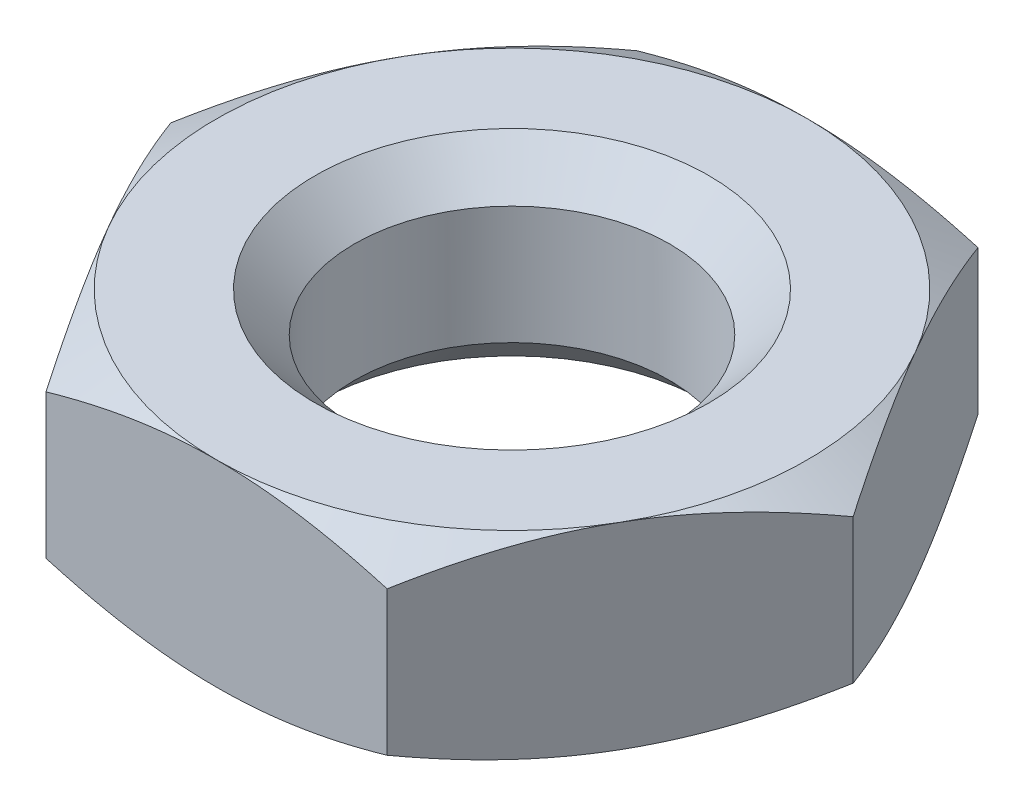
ISO-10303-21;
HEADER;
FILE_DESCRIPTION(('STEP AP214'),'2;1');
FILE_NAME('part.step','',(''),(''),'','','');
FILE_SCHEMA(('AUTOMOTIVE_DESIGN { 1 0 10303 214 1 1 1 1 }'));
ENDSEC;
DATA;
#1=APPLICATION_CONTEXT('core data for automotive mechanical design processes');
#2=APPLICATION_PROTOCOL_DEFINITION('international standard','automotive_design',2000,#1);
#3=PRODUCT_CONTEXT('',#1,'mechanical');
#4=PRODUCT('Part','Part','',(#3));
#5=PRODUCT_RELATED_PRODUCT_CATEGORY('part','',(#4));
#6=PRODUCT_DEFINITION_FORMATION('','',#4);
#7=PRODUCT_DEFINITION_CONTEXT('part definition',#1,'design');
#8=PRODUCT_DEFINITION('design','',#6,#7);
#9=PRODUCT_DEFINITION_SHAPE('','',#8);
#10=(LENGTH_UNIT() NAMED_UNIT(*) SI_UNIT(.MILLI.,.METRE.));
#11=(NAMED_UNIT(*) PLANE_ANGLE_UNIT() SI_UNIT($,.RADIAN.));
#12=(NAMED_UNIT(*) SI_UNIT($,.STERADIAN.) SOLID_ANGLE_UNIT());
#13=UNCERTAINTY_MEASURE_WITH_UNIT(LENGTH_MEASURE(1.E-05),#10,'distance_accuracy_value','');
#14=(GEOMETRIC_REPRESENTATION_CONTEXT(3) GLOBAL_UNCERTAINTY_ASSIGNED_CONTEXT((#13)) GLOBAL_UNIT_ASSIGNED_CONTEXT((#10,
#11,#12)) REPRESENTATION_CONTEXT('',''));
#15=CARTESIAN_POINT('',(0.,0.,0.));
#16=DIRECTION('',(0.,0.,1.));
#17=DIRECTION('',(1.,0.,0.));
#18=AXIS2_PLACEMENT_3D('',#15,#16,#17);
#19=CARTESIAN_POINT('',(0.,6.41280525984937,0.));
#20=DIRECTION('',(0.,-1.,0.));
#21=DIRECTION('',(1.,0.,0.));
#22=AXIS2_PLACEMENT_3D('',#19,#20,#21);
#23=CONICAL_SURFACE('',#22,21.2132034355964,1.04719754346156);
#24=CARTESIAN_POINT('',(-17.3206235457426,8.6601873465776,0.000199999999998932));
#25=CARTESIAN_POINT('',(-17.1302745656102,8.77007818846,-0.329494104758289));
#26=CARTESIAN_POINT('',(-16.9391831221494,8.87498239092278,-0.660474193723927));
#27=CARTESIAN_POINT('',(-16.5554679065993,9.07343140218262,-1.32508844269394));
#28=CARTESIAN_POINT('',(-16.3628436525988,9.16697247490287,-1.65872343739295));
#29=CARTESIAN_POINT('',(-15.975690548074,9.34143784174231,-2.32929228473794));
#30=CARTESIAN_POINT('',(-15.781158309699,9.42233228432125,-2.66623200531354));
#31=CARTESIAN_POINT('',(-15.3907420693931,9.56976735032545,-3.34245276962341));
#32=CARTESIAN_POINT('',(-15.194858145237,9.63630879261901,-3.6817336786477));
#33=CARTESIAN_POINT('',(-14.8067578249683,9.75220762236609,-4.35394315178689));
#34=CARTESIAN_POINT('',(-14.6145702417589,9.80194861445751,-4.68682181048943));
#35=CARTESIAN_POINT('',(-14.229314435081,9.88535325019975,-5.35410444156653));
#36=CARTESIAN_POINT('',(-14.0362461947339,9.91901658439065,-5.68850844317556));
#37=CARTESIAN_POINT('',(-13.6497853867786,9.96941592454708,-6.35787819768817));
#38=CARTESIAN_POINT('',(-13.4563934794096,9.98617204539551,-6.692842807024));
#39=CARTESIAN_POINT('',(-13.0694311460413,10.0023966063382,-7.36308122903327));
#40=CARTESIAN_POINT('',(-12.875860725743,10.001865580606,-7.69835503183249));
#41=CARTESIAN_POINT('',(-12.513982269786,9.98472338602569,-8.3251469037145));
#42=CARTESIAN_POINT('',(-12.3456484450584,9.97020315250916,-8.61670964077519));
#43=CARTESIAN_POINT('',(-12.0093680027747,9.92836285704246,-9.19916445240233));
#44=CARTESIAN_POINT('',(-11.8414214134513,9.90104188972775,-9.49005647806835));
#45=CARTESIAN_POINT('',(-11.5060066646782,9.83407648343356,-10.0710118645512));
#46=CARTESIAN_POINT('',(-11.3385390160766,9.79442186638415,-10.3610743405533));
#47=CARTESIAN_POINT('',(-11.0043888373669,9.70348488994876,-10.9398394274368));
#48=CARTESIAN_POINT('',(-10.8377063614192,9.65220174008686,-11.2285419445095));
#49=CARTESIAN_POINT('',(-10.3317324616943,9.47961312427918,-12.1049144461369));
#50=CARTESIAN_POINT('',(-9.99390625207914,9.34109880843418,-12.6900466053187));
#51=CARTESIAN_POINT('',(-9.32329121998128,9.02672801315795,-13.8515859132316));
#52=CARTESIAN_POINT('',(-8.99049381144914,8.85094536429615,-14.4280079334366));
#53=CARTESIAN_POINT('',(-8.66013856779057,8.66018734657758,-15.0002));
#54=B_SPLINE_CURVE_WITH_KNOTS('',3,(#24,#25,#26,#27,#28,#29,#30,#31,#32,#33,#34,#35,#36,#37,#38,
#39,#40,#41,#42,#43,#44,#45,#46,#47,#48,#49,#50,#51,#52,#53),.UNSPECIFIED.,.F.,.F.,(4,2,2,2,2,2,
2,2,2,2,2,2,2,2,4),(0.,1.18875411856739,2.37789803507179,3.56980779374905,4.76164953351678,
5.92407381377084,7.08652046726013,8.24758249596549,9.40860864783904,10.4193068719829,
11.4300765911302,12.4416826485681,13.4533574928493,15.5211962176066,17.5849760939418),.UNSPECIFIED.);
#55=CARTESIAN_POINT('',(-17.3205080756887,8.66025401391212,0.));
#56=VERTEX_POINT('',#55);
#57=CARTESIAN_POINT('',(-12.9903810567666,10.,-7.49999999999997));
#58=VERTEX_POINT('',#57);
#59=EDGE_CURVE('E340',#56,#58,#54,.T.);
#60=ORIENTED_EDGE('',*,*,#59,.F.);
#61=CARTESIAN_POINT('',(-8.66013856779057,8.66018734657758,15.0002));
#62=CARTESIAN_POINT('',(-8.850487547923,8.77007818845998,14.6705058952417));
#63=CARTESIAN_POINT('',(-9.04157899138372,8.87498239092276,14.3395258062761));
#64=CARTESIAN_POINT('',(-9.42529420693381,9.0734314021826,13.6749115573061));
#65=CARTESIAN_POINT('',(-9.61791846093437,9.16697247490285,13.3412765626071));
#66=CARTESIAN_POINT('',(-10.0050715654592,9.3414378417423,12.6707077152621));
#67=CARTESIAN_POINT('',(-10.1996038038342,9.42233228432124,12.3337679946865));
#68=CARTESIAN_POINT('',(-10.5900200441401,9.56976735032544,11.6575472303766));
#69=CARTESIAN_POINT('',(-10.7859039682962,9.636308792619,11.3182663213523));
#70=CARTESIAN_POINT('',(-11.1740042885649,9.75220762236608,10.6460568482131));
#71=CARTESIAN_POINT('',(-11.3661918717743,9.8019486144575,10.3131781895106));
#72=CARTESIAN_POINT('',(-11.7514476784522,9.88535325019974,9.64589555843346));
#73=CARTESIAN_POINT('',(-11.9445159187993,9.91901658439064,9.31149155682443));
#74=CARTESIAN_POINT('',(-12.3309767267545,9.96941592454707,8.64212180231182));
#75=CARTESIAN_POINT('',(-12.5243686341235,9.98617204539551,8.30715719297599));
#76=CARTESIAN_POINT('',(-12.9113309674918,10.0023966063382,7.63691877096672));
#77=CARTESIAN_POINT('',(-13.1049013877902,10.001865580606,7.3016449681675));
#78=CARTESIAN_POINT('',(-13.4667798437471,9.98472338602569,6.67485309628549));
#79=CARTESIAN_POINT('',(-13.6351136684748,9.97020315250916,6.3832903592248));
#80=CARTESIAN_POINT('',(-13.9713941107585,9.92836285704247,5.80083554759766));
#81=CARTESIAN_POINT('',(-14.1393407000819,9.90104188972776,5.50994352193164));
#82=CARTESIAN_POINT('',(-14.474755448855,9.83407648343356,4.92898813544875));
#83=CARTESIAN_POINT('',(-14.6422230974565,9.79442186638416,4.63892565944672));
#84=CARTESIAN_POINT('',(-14.9763732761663,9.70348488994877,4.0601605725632));
#85=CARTESIAN_POINT('',(-15.1430557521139,9.65220174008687,3.77145805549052));
#86=CARTESIAN_POINT('',(-15.6490296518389,9.47961312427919,2.8950855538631));
#87=CARTESIAN_POINT('',(-15.986855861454,9.34109880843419,2.3099533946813));
#88=CARTESIAN_POINT('',(-16.6574708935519,9.02672801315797,1.14841408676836));
#89=CARTESIAN_POINT('',(-16.990268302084,8.85094536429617,0.571992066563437));
#90=CARTESIAN_POINT('',(-17.3206235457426,8.6601873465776,-0.000199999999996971));
#91=B_SPLINE_CURVE_WITH_KNOTS('',3,(#61,#62,#63,#64,#65,#66,#67,#68,#69,#70,#71,#72,#73,#74,#75,
#76,#77,#78,#79,#80,#81,#82,#83,#84,#85,#86,#87,#88,#89,#90),.UNSPECIFIED.,.F.,.F.,(4,2,2,2,2,2,
2,2,2,2,2,2,2,2,4),(0.,1.18875411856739,2.3778980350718,3.56980779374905,4.76164953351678,
5.92407381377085,7.08652046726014,8.2475824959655,9.40860864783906,10.4193068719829,
11.4300765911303,12.4416826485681,13.4533574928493,15.5211962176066,17.5849760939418),.UNSPECIFIED.);
#92=CARTESIAN_POINT('',(-12.9903810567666,10.,7.49999999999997));
#93=VERTEX_POINT('',#92);
#94=EDGE_CURVE('E186',#93,#56,#91,.T.);
#95=ORIENTED_EDGE('',*,*,#94,.F.);
#96=CARTESIAN_POINT('',(0.,10.,0.));
#97=DIRECTION('',(0.,1.,0.));
#98=DIRECTION('',(-1.,0.,0.));
#99=AXIS2_PLACEMENT_3D('',#96,#97,#98);
#100=CIRCLE('',#99,15.);
#101=EDGE_CURVE('E268',#58,#93,#100,.T.);
#102=ORIENTED_EDGE('',*,*,#101,.F.);
#103=EDGE_LOOP('',(#60,#95,#102));
#104=FACE_BOUND('',#103,.T.);
#105=ADVANCED_FACE('F34',(#104),#23,.T.);
#106=CARTESIAN_POINT('',(-8.66025403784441,8.6602540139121,-15.));
#107=VERTEX_POINT('',#106);
#108=EDGE_CURVE('E192',#58,#107,#54,.T.);
#109=ORIENTED_EDGE('',*,*,#108,.F.);
#110=CARTESIAN_POINT('',(0.,10.,-15.));
#111=VERTEX_POINT('',#110);
#112=EDGE_CURVE('E270',#111,#58,#100,.T.);
#113=ORIENTED_EDGE('',*,*,#112,.F.);
#114=CARTESIAN_POINT('',(-23.2814633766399,2.67039736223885,-15.));
#115=CARTESIAN_POINT('',(-22.9538281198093,2.82940811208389,-15.));
#116=CARTESIAN_POINT('',(-22.6258089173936,2.98762738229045,-15.));
#117=CARTESIAN_POINT('',(-21.9689225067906,3.30230374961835,-15.));
#118=CARTESIAN_POINT('',(-21.6400552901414,3.45876082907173,-15.));
#119=CARTESIAN_POINT('',(-20.6519741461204,3.92526106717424,-15.));
#120=CARTESIAN_POINT('',(-19.9913773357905,4.23238620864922,-15.));
#121=CARTESIAN_POINT('',(-18.6621834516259,4.83865113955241,-15.));
#122=CARTESIAN_POINT('',(-17.9935624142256,5.13773851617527,-15.));
#123=CARTESIAN_POINT('',(-16.6510098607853,5.7237042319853,-15.));
#124=CARTESIAN_POINT('',(-15.9770785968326,6.01058314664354,-15.));
#125=CARTESIAN_POINT('',(-14.6009780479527,6.57791246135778,-15.));
#126=CARTESIAN_POINT('',(-13.8985991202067,6.85785700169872,-15.));
#127=CARTESIAN_POINT('',(-12.4856258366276,7.39660574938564,-15.));
#128=CARTESIAN_POINT('',(-11.7750305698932,7.65540758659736,-15.));
#129=CARTESIAN_POINT('',(-10.3458412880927,8.14508670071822,-15.));
#130=CARTESIAN_POINT('',(-9.62726674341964,8.37602034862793,-15.));
#131=CARTESIAN_POINT('',(-8.17974171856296,8.80257821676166,-15.));
#132=CARTESIAN_POINT('',(-7.45079457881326,8.99821353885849,-15.));
#133=CARTESIAN_POINT('',(-6.35149009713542,9.25758588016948,-15.));
#134=CARTESIAN_POINT('',(-5.98508799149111,9.33818830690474,-15.));
#135=CARTESIAN_POINT('',(-5.24977663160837,9.48707546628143,-15.));
#136=CARTESIAN_POINT('',(-4.88086742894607,9.55536045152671,-15.));
#137=CARTESIAN_POINT('',(-4.14079375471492,9.6784087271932,-15.));
#138=CARTESIAN_POINT('',(-3.76962930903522,9.73317217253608,-15.));
#139=CARTESIAN_POINT('',(-3.02543966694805,9.82808513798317,-15.));
#140=CARTESIAN_POINT('',(-2.65241455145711,9.86823528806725,-15.));
#141=CARTESIAN_POINT('',(-1.90990058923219,9.93262005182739,-15.));
#142=CARTESIAN_POINT('',(-1.54042930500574,9.95705596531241,-15.));
#143=CARTESIAN_POINT('',(-0.800785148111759,9.99028040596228,-15.));
#144=CARTESIAN_POINT('',(-0.430612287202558,9.99906919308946,-15.));
#145=CARTESIAN_POINT('',(0.309774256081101,10.0007903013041,-15.));
#146=CARTESIAN_POINT('',(0.679987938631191,9.99372255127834,-15.));
#147=CARTESIAN_POINT('',(1.41978709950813,9.96390312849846,-15.));
#148=CARTESIAN_POINT('',(1.78937254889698,9.94115075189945,-15.));
#149=CARTESIAN_POINT('',(2.67703968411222,9.86815109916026,-15.));
#150=CARTESIAN_POINT('',(3.19452269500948,9.81049326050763,-15.));
#151=CARTESIAN_POINT('',(4.22566359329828,9.66756388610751,-15.));
#152=CARTESIAN_POINT('',(4.73932095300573,9.58228861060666,-15.));
#153=CARTESIAN_POINT('',(5.7623161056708,9.38715789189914,-15.));
#154=CARTESIAN_POINT('',(6.27165021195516,9.27728330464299,-15.));
#155=CARTESIAN_POINT('',(7.28521654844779,9.03630813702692,-15.));
#156=CARTESIAN_POINT('',(7.78944885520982,8.90520787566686,-15.));
#157=CARTESIAN_POINT('',(8.80388330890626,8.62187888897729,-15.));
#158=CARTESIAN_POINT('',(9.31397251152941,8.46924857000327,-15.));
#159=CARTESIAN_POINT('',(10.3291263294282,8.14818936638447,-15.));
#160=CARTESIAN_POINT('',(10.8341909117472,7.97976037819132,-15.));
#161=CARTESIAN_POINT('',(11.8395443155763,7.62978058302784,-15.));
#162=CARTESIAN_POINT('',(12.3398346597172,7.44823412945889,-15.));
#163=CARTESIAN_POINT('',(13.3362682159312,7.07415799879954,-15.));
#164=CARTESIAN_POINT('',(13.8324114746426,6.88162844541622,-15.));
#165=CARTESIAN_POINT('',(14.9951014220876,6.41798936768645,-15.));
#166=CARTESIAN_POINT('',(15.6601315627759,6.14308265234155,-15.));
#167=CARTESIAN_POINT('',(16.9845867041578,5.58004500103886,-15.));
#168=CARTESIAN_POINT('',(17.6440113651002,5.29191327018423,-15.));
#169=CARTESIAN_POINT('',(18.9582875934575,4.7050499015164,-15.));
#170=CARTESIAN_POINT('',(19.6131381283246,4.40631595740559,-15.));
#171=CARTESIAN_POINT('',(20.9188775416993,3.80036761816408,-15.));
#172=CARTESIAN_POINT('',(21.5697665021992,3.49315339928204,-15.));
#173=CARTESIAN_POINT('',(22.8689334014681,2.87148235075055,-15.));
#174=CARTESIAN_POINT('',(23.5172077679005,2.55701806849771,-15.));
#175=CARTESIAN_POINT('',(24.8109635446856,1.92239686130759,-15.));
#176=CARTESIAN_POINT('',(25.4564449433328,1.60223991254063,-15.));
#177=CARTESIAN_POINT('',(26.7449591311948,0.957242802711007,-15.));
#178=CARTESIAN_POINT('',(27.3879922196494,0.632403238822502,-15.));
#179=CARTESIAN_POINT('',(28.67204255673,-0.0212380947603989,-15.));
#180=CARTESIAN_POINT('',(29.3130597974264,-0.350039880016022,-15.));
#181=CARTESIAN_POINT('',(31.1273189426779,-1.28661427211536,-15.));
#182=CARTESIAN_POINT('',(32.2985274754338,-1.89832573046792,-15.));
#183=CARTESIAN_POINT('',(34.6365647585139,-3.13013975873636,-15.));
#184=CARTESIAN_POINT('',(35.8033933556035,-3.7502426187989,-15.));
#185=CARTESIAN_POINT('',(38.1307381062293,-4.99534651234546,-15.));
#186=CARTESIAN_POINT('',(39.2912627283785,-5.62033172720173,-15.));
#187=CARTESIAN_POINT('',(41.0299793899,-6.5615543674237,-15.));
#188=CARTESIAN_POINT('',(41.6091911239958,-6.87591093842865,-15.));
#189=CARTESIAN_POINT('',(42.7670021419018,-7.5057478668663,-15.));
#190=CARTESIAN_POINT('',(43.3456014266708,-7.82122822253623,-15.));
#191=CARTESIAN_POINT('',(43.9239290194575,-8.13720599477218,-15.));
#192=B_SPLINE_CURVE_WITH_KNOTS('',3,(#114,#115,#116,#117,#118,#119,#120,#121,#122,#123,#124,
#125,#126,#127,#128,#129,#130,#131,#132,#133,#134,#135,#136,#137,#138,#139,#140,#141,#142,#143,
#144,#145,#146,#147,#148,#149,#150,#151,#152,#153,#154,#155,#156,#157,#158,#159,#160,#161,#162,
#163,#164,#165,#166,#167,#168,#169,#170,#171,#172,#173,#174,#175,#176,#177,#178,#179,#180,#181,
#182,#183,#184,#185,#186,#187,#188,#189,#190,#191),.UNSPECIFIED.,.F.,.F.,(4,2,2,2,2,2,2,2,2,2,2,
2,2,2,2,2,2,2,2,2,2,2,2,2,2,2,2,2,2,2,2,2,2,2,2,2,2,2,4),(0.,1.09254711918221,2.18510518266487,
4.37054362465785,6.56784837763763,8.7650494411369,11.033125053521,13.3014545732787,
15.565116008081,17.8280642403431,18.9533795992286,20.0786718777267,21.2039512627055,
22.3291821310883,23.4396954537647,24.5501903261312,25.6606901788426,26.7712398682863,
28.3324320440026,29.8938357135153,31.4564587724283,33.0190583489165,34.6160574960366,
36.2130671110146,37.8095491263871,39.406013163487,41.56465041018,43.7234175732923,
45.8826572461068,48.0418520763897,50.2033752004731,52.3649073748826,54.5261662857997,
56.6874336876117,60.6513806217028,64.6154649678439,68.5697894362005,70.5468460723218,
72.5238996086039),.UNSPECIFIED.);
#193=EDGE_CURVE('E205',#107,#111,#192,.T.);
#194=ORIENTED_EDGE('',*,*,#193,.F.);
#195=EDGE_LOOP('',(#109,#113,#194));
#196=FACE_BOUND('',#195,.T.);
#197=ADVANCED_FACE('F169',(#196),#23,.T.);
#198=CARTESIAN_POINT('',(8.66025403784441,8.6602540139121,-15.));
#199=VERTEX_POINT('',#198);
#200=EDGE_CURVE('E199',#111,#199,#192,.T.);
#201=ORIENTED_EDGE('',*,*,#200,.F.);
#202=CARTESIAN_POINT('',(12.9903810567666,10.,-7.49999999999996));
#203=VERTEX_POINT('',#202);
#204=EDGE_CURVE('E360',#203,#111,#100,.T.);
#205=ORIENTED_EDGE('',*,*,#204,.F.);
#206=CARTESIAN_POINT('',(8.66013856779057,8.66018734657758,-15.0002));
#207=CARTESIAN_POINT('',(8.850487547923,8.77007818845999,-14.6705058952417));
#208=CARTESIAN_POINT('',(9.04157899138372,8.87498239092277,-14.3395258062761));
#209=CARTESIAN_POINT('',(9.42529420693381,9.07343140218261,-13.6749115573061));
#210=CARTESIAN_POINT('',(9.61791846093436,9.16697247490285,-13.3412765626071));
#211=CARTESIAN_POINT('',(10.0050715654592,9.3414378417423,-12.6707077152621));
#212=CARTESIAN_POINT('',(10.1996038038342,9.42233228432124,-12.3337679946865));
#213=CARTESIAN_POINT('',(10.5900200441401,9.56976735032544,-11.6575472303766));
#214=CARTESIAN_POINT('',(10.7859039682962,9.636308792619,-11.3182663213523));
#215=CARTESIAN_POINT('',(11.1740042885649,9.75220762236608,-10.6460568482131));
#216=CARTESIAN_POINT('',(11.3661918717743,9.8019486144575,-10.3131781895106));
#217=CARTESIAN_POINT('',(11.7514476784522,9.88535325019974,-9.64589555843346));
#218=CARTESIAN_POINT('',(11.9445159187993,9.91901658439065,-9.31149155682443));
#219=CARTESIAN_POINT('',(12.3309767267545,9.96941592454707,-8.64212180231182));
#220=CARTESIAN_POINT('',(12.5243686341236,9.98617204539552,-8.30715719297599));
#221=CARTESIAN_POINT('',(12.9113309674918,10.0023966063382,-7.63691877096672));
#222=CARTESIAN_POINT('',(13.1049013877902,10.001865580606,-7.30164496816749));
#223=CARTESIAN_POINT('',(13.4667798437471,9.9847233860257,-6.67485309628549));
#224=CARTESIAN_POINT('',(13.6351136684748,9.97020315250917,-6.3832903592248));
#225=CARTESIAN_POINT('',(13.9713941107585,9.92836285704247,-5.80083554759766));
#226=CARTESIAN_POINT('',(14.1393407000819,9.90104188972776,-5.50994352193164));
#227=CARTESIAN_POINT('',(14.474755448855,9.83407648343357,-4.92898813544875));
#228=CARTESIAN_POINT('',(14.6422230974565,9.79442186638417,-4.63892565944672));
#229=CARTESIAN_POINT('',(14.9763732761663,9.70348488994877,-4.0601605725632));
#230=CARTESIAN_POINT('',(15.1430557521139,9.65220174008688,-3.77145805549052));
#231=CARTESIAN_POINT('',(15.6490296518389,9.47961312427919,-2.8950855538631));
#232=CARTESIAN_POINT('',(15.986855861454,9.3410988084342,-2.3099533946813));
#233=CARTESIAN_POINT('',(16.6574708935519,9.02672801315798,-1.14841408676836));
#234=CARTESIAN_POINT('',(16.990268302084,8.85094536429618,-0.571992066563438));
#235=CARTESIAN_POINT('',(17.3206235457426,8.6601873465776,0.000199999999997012));
#236=B_SPLINE_CURVE_WITH_KNOTS('',3,(#206,#207,#208,#209,#210,#211,#212,#213,#214,#215,#216,
#217,#218,#219,#220,#221,#222,#223,#224,#225,#226,#227,#228,#229,#230,#231,#232,#233,#234,#235),
.UNSPECIFIED.,.F.,.F.,(4,2,2,2,2,2,2,2,2,2,2,2,2,2,4),(0.,1.1887541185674,2.3778980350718,
3.56980779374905,4.76164953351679,5.92407381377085,7.08652046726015,8.24758249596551,
9.40860864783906,10.4193068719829,11.4300765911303,12.4416826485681,13.4533574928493,
15.5211962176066,17.5849760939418),.UNSPECIFIED.);
#237=EDGE_CURVE('E261',#199,#203,#236,.T.);
#238=ORIENTED_EDGE('',*,*,#237,.F.);
#239=EDGE_LOOP('',(#201,#205,#238));
#240=FACE_BOUND('',#239,.T.);
#241=ADVANCED_FACE('F361',(#240),#23,.T.);
#242=CARTESIAN_POINT('',(-8.66025403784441,8.6602540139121,15.));
#243=VERTEX_POINT('',#242);
#244=EDGE_CURVE('E234',#243,#93,#91,.T.);
#245=ORIENTED_EDGE('',*,*,#244,.F.);
#246=CARTESIAN_POINT('',(-23.2814633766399,2.67039736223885,15.));
#247=CARTESIAN_POINT('',(-22.9538281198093,2.82940811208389,15.));
#248=CARTESIAN_POINT('',(-22.6258089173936,2.98762738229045,15.));
#249=CARTESIAN_POINT('',(-21.9689225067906,3.30230374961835,15.));
#250=CARTESIAN_POINT('',(-21.6400552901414,3.45876082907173,15.));
#251=CARTESIAN_POINT('',(-20.6519741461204,3.92526106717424,15.));
#252=CARTESIAN_POINT('',(-19.9913773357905,4.23238620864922,15.));
#253=CARTESIAN_POINT('',(-18.6621834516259,4.83865113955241,15.));
#254=CARTESIAN_POINT('',(-17.9935624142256,5.13773851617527,15.));
#255=CARTESIAN_POINT('',(-16.6510098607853,5.7237042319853,15.));
#256=CARTESIAN_POINT('',(-15.9770785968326,6.01058314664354,15.));
#257=CARTESIAN_POINT('',(-14.6009780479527,6.57791246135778,15.));
#258=CARTESIAN_POINT('',(-13.8985991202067,6.85785700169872,15.));
#259=CARTESIAN_POINT('',(-12.4856258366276,7.39660574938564,15.));
#260=CARTESIAN_POINT('',(-11.7750305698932,7.65540758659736,15.));
#261=CARTESIAN_POINT('',(-10.3458412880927,8.14508670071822,15.));
#262=CARTESIAN_POINT('',(-9.62726674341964,8.37602034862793,15.));
#263=CARTESIAN_POINT('',(-8.17974171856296,8.80257821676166,15.));
#264=CARTESIAN_POINT('',(-7.45079457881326,8.99821353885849,15.));
#265=CARTESIAN_POINT('',(-6.35149009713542,9.25758588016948,15.));
#266=CARTESIAN_POINT('',(-5.98508799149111,9.33818830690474,15.));
#267=CARTESIAN_POINT('',(-5.24977663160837,9.48707546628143,15.));
#268=CARTESIAN_POINT('',(-4.88086742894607,9.55536045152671,15.));
#269=CARTESIAN_POINT('',(-4.14079375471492,9.6784087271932,15.));
#270=CARTESIAN_POINT('',(-3.76962930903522,9.73317217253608,15.));
#271=CARTESIAN_POINT('',(-3.02543966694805,9.82808513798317,15.));
#272=CARTESIAN_POINT('',(-2.65241455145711,9.86823528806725,15.));
#273=CARTESIAN_POINT('',(-1.90990058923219,9.93262005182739,15.));
#274=CARTESIAN_POINT('',(-1.54042930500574,9.95705596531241,15.));
#275=CARTESIAN_POINT('',(-0.800785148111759,9.99028040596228,15.));
#276=CARTESIAN_POINT('',(-0.430612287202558,9.99906919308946,15.));
#277=CARTESIAN_POINT('',(0.309774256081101,10.0007903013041,15.));
#278=CARTESIAN_POINT('',(0.679987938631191,9.99372255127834,15.));
#279=CARTESIAN_POINT('',(1.41978709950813,9.96390312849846,15.));
#280=CARTESIAN_POINT('',(1.78937254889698,9.94115075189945,15.));
#281=CARTESIAN_POINT('',(2.67703968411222,9.86815109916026,15.));
#282=CARTESIAN_POINT('',(3.19452269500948,9.81049326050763,15.));
#283=CARTESIAN_POINT('',(4.22566359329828,9.66756388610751,15.));
#284=CARTESIAN_POINT('',(4.73932095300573,9.58228861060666,15.));
#285=CARTESIAN_POINT('',(5.7623161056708,9.38715789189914,15.));
#286=CARTESIAN_POINT('',(6.27165021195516,9.27728330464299,15.));
#287=CARTESIAN_POINT('',(7.28521654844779,9.03630813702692,15.));
#288=CARTESIAN_POINT('',(7.78944885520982,8.90520787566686,15.));
#289=CARTESIAN_POINT('',(8.80388330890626,8.62187888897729,15.));
#290=CARTESIAN_POINT('',(9.31397251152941,8.46924857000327,15.));
#291=CARTESIAN_POINT('',(10.3291263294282,8.14818936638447,15.));
#292=CARTESIAN_POINT('',(10.8341909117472,7.97976037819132,15.));
#293=CARTESIAN_POINT('',(11.8395443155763,7.62978058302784,15.));
#294=CARTESIAN_POINT('',(12.3398346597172,7.44823412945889,15.));
#295=CARTESIAN_POINT('',(13.3362682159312,7.07415799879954,15.));
#296=CARTESIAN_POINT('',(13.8324114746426,6.88162844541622,15.));
#297=CARTESIAN_POINT('',(14.9951014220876,6.41798936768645,15.));
#298=CARTESIAN_POINT('',(15.6601315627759,6.14308265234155,15.));
#299=CARTESIAN_POINT('',(16.9845867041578,5.58004500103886,15.));
#300=CARTESIAN_POINT('',(17.6440113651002,5.29191327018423,15.));
#301=CARTESIAN_POINT('',(18.9582875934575,4.7050499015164,15.));
#302=CARTESIAN_POINT('',(19.6131381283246,4.40631595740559,15.));
#303=CARTESIAN_POINT('',(20.9188775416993,3.80036761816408,15.));
#304=CARTESIAN_POINT('',(21.5697665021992,3.49315339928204,15.));
#305=CARTESIAN_POINT('',(22.8689334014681,2.87148235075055,15.));
#306=CARTESIAN_POINT('',(23.5172077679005,2.55701806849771,15.));
#307=CARTESIAN_POINT('',(24.8109635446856,1.92239686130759,15.));
#308=CARTESIAN_POINT('',(25.4564449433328,1.60223991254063,15.));
#309=CARTESIAN_POINT('',(26.7449591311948,0.957242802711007,15.));
#310=CARTESIAN_POINT('',(27.3879922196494,0.632403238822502,15.));
#311=CARTESIAN_POINT('',(28.67204255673,-0.0212380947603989,15.));
#312=CARTESIAN_POINT('',(29.3130597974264,-0.350039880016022,15.));
#313=CARTESIAN_POINT('',(31.1273189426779,-1.28661427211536,15.));
#314=CARTESIAN_POINT('',(32.2985274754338,-1.89832573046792,15.));
#315=CARTESIAN_POINT('',(34.6365647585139,-3.13013975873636,15.));
#316=CARTESIAN_POINT('',(35.8033933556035,-3.7502426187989,15.));
#317=CARTESIAN_POINT('',(38.1307381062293,-4.99534651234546,15.));
#318=CARTESIAN_POINT('',(39.2912627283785,-5.62033172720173,15.));
#319=CARTESIAN_POINT('',(41.0299793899,-6.5615543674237,15.));
#320=CARTESIAN_POINT('',(41.6091911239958,-6.87591093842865,15.));
#321=CARTESIAN_POINT('',(42.7670021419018,-7.5057478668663,15.));
#322=CARTESIAN_POINT('',(43.3456014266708,-7.82122822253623,15.));
#323=CARTESIAN_POINT('',(43.9239290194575,-8.13720599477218,15.));
#324=B_SPLINE_CURVE_WITH_KNOTS('',3,(#246,#247,#248,#249,#250,#251,#252,#253,#254,#255,#256,
#257,#258,#259,#260,#261,#262,#263,#264,#265,#266,#267,#268,#269,#270,#271,#272,#273,#274,#275,
#276,#277,#278,#279,#280,#281,#282,#283,#284,#285,#286,#287,#288,#289,#290,#291,#292,#293,#294,
#295,#296,#297,#298,#299,#300,#301,#302,#303,#304,#305,#306,#307,#308,#309,#310,#311,#312,#313,
#314,#315,#316,#317,#318,#319,#320,#321,#322,#323),.UNSPECIFIED.,.F.,.F.,(4,2,2,2,2,2,2,2,2,2,2,
2,2,2,2,2,2,2,2,2,2,2,2,2,2,2,2,2,2,2,2,2,2,2,2,2,2,2,4),(0.,1.09254711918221,2.18510518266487,
4.37054362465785,6.56784837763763,8.7650494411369,11.033125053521,13.3014545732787,
15.565116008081,17.8280642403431,18.9533795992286,20.0786718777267,21.2039512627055,
22.3291821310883,23.4396954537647,24.5501903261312,25.6606901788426,26.7712398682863,
28.3324320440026,29.8938357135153,31.4564587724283,33.0190583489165,34.6160574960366,
36.2130671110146,37.8095491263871,39.406013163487,41.56465041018,43.7234175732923,
45.8826572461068,48.0418520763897,50.2033752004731,52.3649073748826,54.5261662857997,
56.6874336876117,60.6513806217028,64.6154649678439,68.5697894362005,70.5468460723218,
72.5238996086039),.UNSPECIFIED.);
#325=CARTESIAN_POINT('',(0.,10.,15.));
#326=VERTEX_POINT('',#325);
#327=EDGE_CURVE('E144',#326,#243,#324,.F.);
#328=ORIENTED_EDGE('',*,*,#327,.F.);
#329=EDGE_CURVE('E272',#93,#326,#100,.T.);
#330=ORIENTED_EDGE('',*,*,#329,.F.);
#331=EDGE_LOOP('',(#245,#328,#330));
#332=FACE_BOUND('',#331,.T.);
#333=ADVANCED_FACE('F364',(#332),#23,.T.);
#334=CARTESIAN_POINT('',(17.3205080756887,8.66025401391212,0.));
#335=VERTEX_POINT('',#334);
#336=EDGE_CURVE('E274',#203,#335,#236,.T.);
#337=ORIENTED_EDGE('',*,*,#336,.F.);
#338=CARTESIAN_POINT('',(12.9903810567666,10.,7.49999999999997));
#339=VERTEX_POINT('',#338);
#340=EDGE_CURVE('E359',#339,#203,#100,.T.);
#341=ORIENTED_EDGE('',*,*,#340,.F.);
#342=CARTESIAN_POINT('',(17.3206235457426,8.6601873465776,-0.000199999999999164));
#343=CARTESIAN_POINT('',(17.1302745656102,8.77007818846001,0.329494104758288));
#344=CARTESIAN_POINT('',(16.9391831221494,8.87498239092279,0.660474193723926));
#345=CARTESIAN_POINT('',(16.5554679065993,9.07343140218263,1.32508844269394));
#346=CARTESIAN_POINT('',(16.3628436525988,9.16697247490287,1.65872343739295));
#347=CARTESIAN_POINT('',(15.975690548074,9.34143784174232,2.32929228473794));
#348=CARTESIAN_POINT('',(15.781158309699,9.42233228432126,2.66623200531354));
#349=CARTESIAN_POINT('',(15.3907420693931,9.56976735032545,3.34245276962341));
#350=CARTESIAN_POINT('',(15.194858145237,9.63630879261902,3.6817336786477));
#351=CARTESIAN_POINT('',(14.8067578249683,9.75220762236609,4.35394315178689));
#352=CARTESIAN_POINT('',(14.6145702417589,9.80194861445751,4.68682181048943));
#353=CARTESIAN_POINT('',(14.229314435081,9.88535325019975,5.35410444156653));
#354=CARTESIAN_POINT('',(14.0362461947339,9.91901658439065,5.68850844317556));
#355=CARTESIAN_POINT('',(13.6497853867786,9.96941592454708,6.35787819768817));
#356=CARTESIAN_POINT('',(13.4563934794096,9.98617204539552,6.692842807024));
#357=CARTESIAN_POINT('',(13.0694311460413,10.0023966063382,7.36308122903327));
#358=CARTESIAN_POINT('',(12.875860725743,10.001865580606,7.69835503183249));
#359=CARTESIAN_POINT('',(12.513982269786,9.9847233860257,8.32514690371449));
#360=CARTESIAN_POINT('',(12.3456484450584,9.97020315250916,8.61670964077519));
#361=CARTESIAN_POINT('',(12.0093680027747,9.92836285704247,9.19916445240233));
#362=CARTESIAN_POINT('',(11.8414214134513,9.90104188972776,9.49005647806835));
#363=CARTESIAN_POINT('',(11.5060066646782,9.83407648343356,10.0710118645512));
#364=CARTESIAN_POINT('',(11.3385390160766,9.79442186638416,10.3610743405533));
#365=CARTESIAN_POINT('',(11.0043888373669,9.70348488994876,10.9398394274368));
#366=CARTESIAN_POINT('',(10.8377063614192,9.65220174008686,11.2285419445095));
#367=CARTESIAN_POINT('',(10.3317324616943,9.47961312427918,12.1049144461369));
#368=CARTESIAN_POINT('',(9.99390625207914,9.34109880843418,12.6900466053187));
#369=CARTESIAN_POINT('',(9.32329121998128,9.02672801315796,13.8515859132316));
#370=CARTESIAN_POINT('',(8.99049381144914,8.85094536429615,14.4280079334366));
#371=CARTESIAN_POINT('',(8.66013856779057,8.66018734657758,15.0002));
#372=B_SPLINE_CURVE_WITH_KNOTS('',3,(#342,#343,#344,#345,#346,#347,#348,#349,#350,#351,#352,
#353,#354,#355,#356,#357,#358,#359,#360,#361,#362,#363,#364,#365,#366,#367,#368,#369,#370,#371),
.UNSPECIFIED.,.F.,.F.,(4,2,2,2,2,2,2,2,2,2,2,2,2,2,4),(0.,1.18875411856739,2.37789803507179,
3.56980779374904,4.76164953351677,5.92407381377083,7.08652046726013,8.24758249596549,
9.40860864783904,10.4193068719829,11.4300765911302,12.4416826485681,13.4533574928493,
15.5211962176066,17.5849760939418),.UNSPECIFIED.);
#373=EDGE_CURVE('E49',#335,#339,#372,.T.);
#374=ORIENTED_EDGE('',*,*,#373,.F.);
#375=EDGE_LOOP('',(#337,#341,#374));
#376=FACE_BOUND('',#375,.T.);
#377=ADVANCED_FACE('F357',(#376),#23,.T.);
#378=CARTESIAN_POINT('',(8.66025403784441,8.6602540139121,15.));
#379=VERTEX_POINT('',#378);
#380=EDGE_CURVE('E132',#379,#326,#324,.F.);
#381=ORIENTED_EDGE('',*,*,#380,.F.);
#382=EDGE_CURVE('E121',#339,#379,#372,.T.);
#383=ORIENTED_EDGE('',*,*,#382,.F.);
#384=EDGE_CURVE('E141',#326,#339,#100,.T.);
#385=ORIENTED_EDGE('',*,*,#384,.F.);
#386=EDGE_LOOP('',(#381,#383,#385));
#387=FACE_BOUND('',#386,.T.);
#388=ADVANCED_FACE('F139',(#387),#23,.T.);
#389=CARTESIAN_POINT('',(0.,0.,0.));
#390=DIRECTION('',(0.,1.,0.));
#391=DIRECTION('',(-1.,0.,0.));
#392=AXIS2_PLACEMENT_3D('',#389,#390,#391);
#393=CONICAL_SURFACE('',#392,15.,1.04719754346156);
#394=CARTESIAN_POINT('',(17.3206235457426,1.3398126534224,0.000199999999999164));
#395=CARTESIAN_POINT('',(17.1302745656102,1.22992181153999,-0.329494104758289));
#396=CARTESIAN_POINT('',(16.9391831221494,1.12501760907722,-0.660474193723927));
#397=CARTESIAN_POINT('',(16.5554679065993,0.926568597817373,-1.32508844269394));
#398=CARTESIAN_POINT('',(16.3628436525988,0.83302752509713,-1.65872343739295));
#399=CARTESIAN_POINT('',(15.975690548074,0.658562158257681,-2.32929228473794));
#400=CARTESIAN_POINT('',(15.781158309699,0.577667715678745,-2.66623200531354));
#401=CARTESIAN_POINT('',(15.3907420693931,0.430232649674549,-3.34245276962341));
#402=CARTESIAN_POINT('',(15.194858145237,0.363691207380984,-3.6817336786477));
#403=CARTESIAN_POINT('',(14.8067578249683,0.24779237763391,-4.35394315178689));
#404=CARTESIAN_POINT('',(14.6145702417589,0.198051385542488,-4.68682181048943));
#405=CARTESIAN_POINT('',(14.229314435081,0.114646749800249,-5.35410444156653));
#406=CARTESIAN_POINT('',(14.0362461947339,0.0809834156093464,-5.68850844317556));
#407=CARTESIAN_POINT('',(13.6497853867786,0.0305840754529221,-6.35787819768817));
#408=CARTESIAN_POINT('',(13.4563934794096,0.0138279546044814,-6.692842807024));
#409=CARTESIAN_POINT('',(13.0694311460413,-0.00239660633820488,-7.36308122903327));
#410=CARTESIAN_POINT('',(12.875860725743,-0.00186558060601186,-7.69835503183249));
#411=CARTESIAN_POINT('',(12.513982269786,0.0152766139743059,-8.32514690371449));
#412=CARTESIAN_POINT('',(12.3456484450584,0.0297968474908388,-8.61670964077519));
#413=CARTESIAN_POINT('',(12.0093680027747,0.0716371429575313,-9.19916445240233));
#414=CARTESIAN_POINT('',(11.8414214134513,0.0989581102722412,-9.49005647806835));
#415=CARTESIAN_POINT('',(11.5060066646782,0.16592351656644,-10.0710118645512));
#416=CARTESIAN_POINT('',(11.3385390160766,0.205578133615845,-10.3610743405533));
#417=CARTESIAN_POINT('',(11.0043888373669,0.29651511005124,-10.9398394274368));
#418=CARTESIAN_POINT('',(10.8377063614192,0.347798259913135,-11.2285419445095));
#419=CARTESIAN_POINT('',(10.3317324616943,0.520386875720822,-12.1049144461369));
#420=CARTESIAN_POINT('',(9.99390625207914,0.65890119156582,-12.6900466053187));
#421=CARTESIAN_POINT('',(9.32329121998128,0.973271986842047,-13.8515859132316));
#422=CARTESIAN_POINT('',(8.99049381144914,1.14905463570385,-14.4280079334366));
#423=CARTESIAN_POINT('',(8.66013856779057,1.33981265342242,-15.0002));
#424=B_SPLINE_CURVE_WITH_KNOTS('',3,(#394,#395,#396,#397,#398,#399,#400,#401,#402,#403,#404,
#405,#406,#407,#408,#409,#410,#411,#412,#413,#414,#415,#416,#417,#418,#419,#420,#421,#422,#423),
.UNSPECIFIED.,.F.,.F.,(4,2,2,2,2,2,2,2,2,2,2,2,2,2,4),(0.,1.18875411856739,2.37789803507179,
3.56980779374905,4.76164953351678,5.92407381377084,7.08652046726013,8.24758249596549,
9.40860864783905,10.4193068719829,11.4300765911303,12.4416826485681,13.4533574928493,
15.5211962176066,17.5849760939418),.UNSPECIFIED.);
#425=CARTESIAN_POINT('',(17.3205080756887,1.33974598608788,0.));
#426=VERTEX_POINT('',#425);
#427=CARTESIAN_POINT('',(12.9903810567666,0.,-7.49999999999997));
#428=VERTEX_POINT('',#427);
#429=EDGE_CURVE('E351',#426,#428,#424,.T.);
#430=ORIENTED_EDGE('',*,*,#429,.F.);
#431=CARTESIAN_POINT('',(8.66013856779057,1.33981265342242,15.0002));
#432=CARTESIAN_POINT('',(8.850487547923,1.22992181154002,14.6705058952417));
#433=CARTESIAN_POINT('',(9.04157899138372,1.12501760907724,14.3395258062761));
#434=CARTESIAN_POINT('',(9.42529420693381,0.926568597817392,13.6749115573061));
#435=CARTESIAN_POINT('',(9.61791846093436,0.833027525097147,13.341276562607));
#436=CARTESIAN_POINT('',(10.0050715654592,0.658562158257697,12.6707077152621));
#437=CARTESIAN_POINT('',(10.1996038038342,0.577667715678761,12.3337679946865));
#438=CARTESIAN_POINT('',(10.5900200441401,0.430232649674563,11.6575472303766));
#439=CARTESIAN_POINT('',(10.7859039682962,0.363691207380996,11.3182663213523));
#440=CARTESIAN_POINT('',(11.1740042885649,0.247792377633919,10.6460568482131));
#441=CARTESIAN_POINT('',(11.3661918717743,0.198051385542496,10.3131781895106));
#442=CARTESIAN_POINT('',(11.7514476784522,0.114646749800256,9.64589555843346));
#443=CARTESIAN_POINT('',(11.9445159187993,0.0809834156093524,9.31149155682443));
#444=CARTESIAN_POINT('',(12.3309767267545,0.030584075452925,8.64212180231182));
#445=CARTESIAN_POINT('',(12.5243686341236,0.0138279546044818,8.30715719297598));
#446=CARTESIAN_POINT('',(12.9113309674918,-0.00239660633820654,7.63691877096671));
#447=CARTESIAN_POINT('',(13.1049013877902,-0.00186558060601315,7.30164496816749));
#448=CARTESIAN_POINT('',(13.4667798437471,0.015276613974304,6.67485309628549));
#449=CARTESIAN_POINT('',(13.6351136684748,0.0297968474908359,6.3832903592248));
#450=CARTESIAN_POINT('',(13.9713941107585,0.0716371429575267,5.80083554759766));
#451=CARTESIAN_POINT('',(14.1393407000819,0.0989581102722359,5.50994352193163));
#452=CARTESIAN_POINT('',(14.474755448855,0.165923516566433,4.92898813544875));
#453=CARTESIAN_POINT('',(14.6422230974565,0.205578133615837,4.63892565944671));
#454=CARTESIAN_POINT('',(14.9763732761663,0.29651511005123,4.0601605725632));
#455=CARTESIAN_POINT('',(15.1430557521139,0.347798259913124,3.77145805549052));
#456=CARTESIAN_POINT('',(15.6490296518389,0.520386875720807,2.8950855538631));
#457=CARTESIAN_POINT('',(15.986855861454,0.658901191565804,2.30995339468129));
#458=CARTESIAN_POINT('',(16.6574708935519,0.973271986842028,1.14841408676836));
#459=CARTESIAN_POINT('',(16.990268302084,1.14905463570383,0.571992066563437));
#460=CARTESIAN_POINT('',(17.3206235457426,1.3398126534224,-0.000199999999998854));
#461=B_SPLINE_CURVE_WITH_KNOTS('',3,(#431,#432,#433,#434,#435,#436,#437,#438,#439,#440,#441,
#442,#443,#444,#445,#446,#447,#448,#449,#450,#451,#452,#453,#454,#455,#456,#457,#458,#459,#460),
.UNSPECIFIED.,.F.,.F.,(4,2,2,2,2,2,2,2,2,2,2,2,2,2,4),(0.,1.1887541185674,2.3778980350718,
3.56980779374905,4.76164953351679,5.92407381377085,7.08652046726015,8.24758249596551,
9.40860864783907,10.4193068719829,11.4300765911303,12.4416826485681,13.4533574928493,
15.5211962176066,17.5849760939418),.UNSPECIFIED.);
#462=CARTESIAN_POINT('',(12.9903810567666,0.,7.49999999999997));
#463=VERTEX_POINT('',#462);
#464=EDGE_CURVE('E315',#463,#426,#461,.T.);
#465=ORIENTED_EDGE('',*,*,#464,.F.);
#466=CARTESIAN_POINT('',(0.,0.,0.));
#467=DIRECTION('',(0.,1.,0.));
#468=DIRECTION('',(-1.,0.,0.));
#469=AXIS2_PLACEMENT_3D('',#466,#467,#468);
#470=CIRCLE('',#469,15.);
#471=EDGE_CURVE('E273',#463,#428,#470,.T.);
#472=ORIENTED_EDGE('',*,*,#471,.T.);
#473=EDGE_LOOP('',(#430,#465,#472));
#474=FACE_BOUND('',#473,.T.);
#475=ADVANCED_FACE('F171',(#474),#393,.T.);
#476=CARTESIAN_POINT('',(8.66025403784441,1.3397459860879,-15.));
#477=VERTEX_POINT('',#476);
#478=EDGE_CURVE('E211',#428,#477,#424,.T.);
#479=ORIENTED_EDGE('',*,*,#478,.F.);
#480=CARTESIAN_POINT('',(0.,0.,-15.));
#481=VERTEX_POINT('',#480);
#482=EDGE_CURVE('E339',#428,#481,#470,.T.);
#483=ORIENTED_EDGE('',*,*,#482,.T.);
#484=CARTESIAN_POINT('',(-23.2814633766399,7.32960263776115,-15.));
#485=CARTESIAN_POINT('',(-22.9538281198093,7.17059188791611,-15.));
#486=CARTESIAN_POINT('',(-22.6258089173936,7.01237261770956,-15.));
#487=CARTESIAN_POINT('',(-21.9689225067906,6.69769625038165,-15.));
#488=CARTESIAN_POINT('',(-21.6400552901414,6.54123917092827,-15.));
#489=CARTESIAN_POINT('',(-20.6519741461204,6.07473893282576,-15.));
#490=CARTESIAN_POINT('',(-19.9913773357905,5.76761379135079,-15.));
#491=CARTESIAN_POINT('',(-18.6621834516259,5.16134886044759,-15.));
#492=CARTESIAN_POINT('',(-17.9935624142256,4.86226148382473,-15.));
#493=CARTESIAN_POINT('',(-16.6510098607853,4.2762957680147,-15.));
#494=CARTESIAN_POINT('',(-15.9770785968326,3.98941685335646,-15.));
#495=CARTESIAN_POINT('',(-14.6009780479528,3.42208753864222,-15.));
#496=CARTESIAN_POINT('',(-13.8985991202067,3.14214299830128,-15.));
#497=CARTESIAN_POINT('',(-12.4856258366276,2.60339425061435,-15.));
#498=CARTESIAN_POINT('',(-11.7750305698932,2.34459241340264,-15.));
#499=CARTESIAN_POINT('',(-10.3458412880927,1.85491329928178,-15.));
#500=CARTESIAN_POINT('',(-9.62726674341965,1.62397965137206,-15.));
#501=CARTESIAN_POINT('',(-8.17974171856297,1.19742178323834,-15.));
#502=CARTESIAN_POINT('',(-7.45079457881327,1.0017864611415,-15.));
#503=CARTESIAN_POINT('',(-6.35149009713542,0.742414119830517,-15.));
#504=CARTESIAN_POINT('',(-5.98508799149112,0.661811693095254,-15.));
#505=CARTESIAN_POINT('',(-5.24977663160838,0.512924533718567,-15.));
#506=CARTESIAN_POINT('',(-4.88086742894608,0.444639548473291,-15.));
#507=CARTESIAN_POINT('',(-4.14079375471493,0.321591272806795,-15.));
#508=CARTESIAN_POINT('',(-3.76962930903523,0.266827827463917,-15.));
#509=CARTESIAN_POINT('',(-3.02543966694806,0.171914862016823,-15.));
#510=CARTESIAN_POINT('',(-2.65241455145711,0.131764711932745,-15.));
#511=CARTESIAN_POINT('',(-1.90990058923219,0.06737994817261,-15.));
#512=CARTESIAN_POINT('',(-1.54042930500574,0.0429440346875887,-15.));
#513=CARTESIAN_POINT('',(-0.800785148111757,0.0097195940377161,-15.));
#514=CARTESIAN_POINT('',(-0.430612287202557,0.000930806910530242,-15.));
#515=CARTESIAN_POINT('',(0.309774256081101,-0.000790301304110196,-15.));
#516=CARTESIAN_POINT('',(0.67998793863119,0.00627744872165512,-15.));
#517=CARTESIAN_POINT('',(1.41978709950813,0.0360968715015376,-15.));
#518=CARTESIAN_POINT('',(1.78937254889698,0.0588492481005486,-15.));
#519=CARTESIAN_POINT('',(2.67703968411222,0.131848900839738,-15.));
#520=CARTESIAN_POINT('',(3.19452269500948,0.189506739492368,-15.));
#521=CARTESIAN_POINT('',(4.22566359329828,0.33243611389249,-15.));
#522=CARTESIAN_POINT('',(4.73932095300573,0.417711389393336,-15.));
#523=CARTESIAN_POINT('',(5.76231610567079,0.61284210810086,-15.));
#524=CARTESIAN_POINT('',(6.27165021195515,0.722716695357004,-15.));
#525=CARTESIAN_POINT('',(7.28521654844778,0.963691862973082,-15.));
#526=CARTESIAN_POINT('',(7.78944885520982,1.09479212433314,-15.));
#527=CARTESIAN_POINT('',(8.80388330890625,1.3781211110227,-15.));
#528=CARTESIAN_POINT('',(9.3139725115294,1.53075142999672,-15.));
#529=CARTESIAN_POINT('',(10.3291263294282,1.85181063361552,-15.));
#530=CARTESIAN_POINT('',(10.8341909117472,2.02023962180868,-15.));
#531=CARTESIAN_POINT('',(11.8395443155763,2.37021941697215,-15.));
#532=CARTESIAN_POINT('',(12.3398346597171,2.5517658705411,-15.));
#533=CARTESIAN_POINT('',(13.3362682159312,2.92584200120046,-15.));
#534=CARTESIAN_POINT('',(13.8324114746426,3.11837155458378,-15.));
#535=CARTESIAN_POINT('',(14.9951014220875,3.58201063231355,-15.));
#536=CARTESIAN_POINT('',(15.6601315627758,3.85691734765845,-15.));
#537=CARTESIAN_POINT('',(16.9845867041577,4.41995499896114,-15.));
#538=CARTESIAN_POINT('',(17.6440113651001,4.70808672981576,-15.));
#539=CARTESIAN_POINT('',(18.9582875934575,5.2949500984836,-15.));
#540=CARTESIAN_POINT('',(19.6131381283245,5.59368404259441,-15.));
#541=CARTESIAN_POINT('',(20.9188775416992,6.19963238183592,-15.));
#542=CARTESIAN_POINT('',(21.5697665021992,6.50684660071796,-15.));
#543=CARTESIAN_POINT('',(22.8689334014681,7.12851764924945,-15.));
#544=CARTESIAN_POINT('',(23.5172077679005,7.44298193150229,-15.));
#545=CARTESIAN_POINT('',(24.8109635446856,8.07760313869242,-15.));
#546=CARTESIAN_POINT('',(25.4564449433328,8.39776008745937,-15.));
#547=CARTESIAN_POINT('',(26.7449591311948,9.042757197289,-15.));
#548=CARTESIAN_POINT('',(27.3879922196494,9.3675967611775,-15.));
#549=CARTESIAN_POINT('',(28.67204255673,10.0212380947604,-15.));
#550=CARTESIAN_POINT('',(29.3130597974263,10.350039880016,-15.));
#551=CARTESIAN_POINT('',(31.1273189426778,11.2866142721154,-15.));
#552=CARTESIAN_POINT('',(32.2985274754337,11.8983257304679,-15.));
#553=CARTESIAN_POINT('',(34.6365647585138,13.1301397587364,-15.));
#554=CARTESIAN_POINT('',(35.8033933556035,13.7502426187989,-15.));
#555=CARTESIAN_POINT('',(38.1307381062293,14.9953465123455,-15.));
#556=CARTESIAN_POINT('',(39.2912627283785,15.6203317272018,-15.));
#557=CARTESIAN_POINT('',(41.0299793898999,16.5615543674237,-15.));
#558=CARTESIAN_POINT('',(41.6091911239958,16.8759109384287,-15.));
#559=CARTESIAN_POINT('',(42.7670021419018,17.5057478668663,-15.));
#560=CARTESIAN_POINT('',(43.3456014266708,17.8212282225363,-15.));
#561=CARTESIAN_POINT('',(43.9239290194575,18.1372059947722,-15.));
#562=B_SPLINE_CURVE_WITH_KNOTS('',3,(#484,#485,#486,#487,#488,#489,#490,#491,#492,#493,#494,
#495,#496,#497,#498,#499,#500,#501,#502,#503,#504,#505,#506,#507,#508,#509,#510,#511,#512,#513,
#514,#515,#516,#517,#518,#519,#520,#521,#522,#523,#524,#525,#526,#527,#528,#529,#530,#531,#532,
#533,#534,#535,#536,#537,#538,#539,#540,#541,#542,#543,#544,#545,#546,#547,#548,#549,#550,#551,
#552,#553,#554,#555,#556,#557,#558,#559,#560,#561),.UNSPECIFIED.,.F.,.F.,(4,2,2,2,2,2,2,2,2,2,2,
2,2,2,2,2,2,2,2,2,2,2,2,2,2,2,2,2,2,2,2,2,2,2,2,2,2,2,4),(0.,1.0925471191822,2.18510518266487,
4.37054362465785,6.56784837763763,8.76504944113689,11.033125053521,13.3014545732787,
15.565116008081,17.8280642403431,18.9533795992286,20.0786718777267,21.2039512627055,
22.3291821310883,23.4396954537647,24.5501903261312,25.6606901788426,26.7712398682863,
28.3324320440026,29.8938357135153,31.4564587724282,33.0190583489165,34.6160574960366,
36.2130671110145,37.8095491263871,39.406013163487,41.5646504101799,43.7234175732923,
45.8826572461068,48.0418520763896,50.203375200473,52.3649073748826,54.5261662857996,
56.6874336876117,60.6513806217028,64.6154649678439,68.5697894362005,70.5468460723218,
72.5238996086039),.UNSPECIFIED.);
#563=EDGE_CURVE('E206',#477,#481,#562,.F.);
#564=ORIENTED_EDGE('',*,*,#563,.F.);
#565=EDGE_LOOP('',(#479,#483,#564));
#566=FACE_BOUND('',#565,.T.);
#567=ADVANCED_FACE('F337',(#566),#393,.T.);
#568=CARTESIAN_POINT('',(-8.66025403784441,1.3397459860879,-15.));
#569=VERTEX_POINT('',#568);
#570=EDGE_CURVE('E207',#481,#569,#562,.F.);
#571=ORIENTED_EDGE('',*,*,#570,.F.);
#572=CARTESIAN_POINT('',(-12.9903810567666,0.,-7.49999999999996));
#573=VERTEX_POINT('',#572);
#574=EDGE_CURVE('E260',#481,#573,#470,.T.);
#575=ORIENTED_EDGE('',*,*,#574,.T.);
#576=CARTESIAN_POINT('',(-8.66013856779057,1.33981265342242,-15.0002));
#577=CARTESIAN_POINT('',(-8.850487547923,1.22992181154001,-14.6705058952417));
#578=CARTESIAN_POINT('',(-9.04157899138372,1.12501760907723,-14.3395258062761));
#579=CARTESIAN_POINT('',(-9.42529420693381,0.926568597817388,-13.6749115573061));
#580=CARTESIAN_POINT('',(-9.61791846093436,0.833027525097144,-13.3412765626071));
#581=CARTESIAN_POINT('',(-10.0050715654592,0.658562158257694,-12.6707077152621));
#582=CARTESIAN_POINT('',(-10.1996038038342,0.577667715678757,-12.3337679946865));
#583=CARTESIAN_POINT('',(-10.5900200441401,0.430232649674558,-11.6575472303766));
#584=CARTESIAN_POINT('',(-10.7859039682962,0.363691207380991,-11.3182663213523));
#585=CARTESIAN_POINT('',(-11.1740042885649,0.247792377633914,-10.6460568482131));
#586=CARTESIAN_POINT('',(-11.3661918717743,0.198051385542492,-10.3131781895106));
#587=CARTESIAN_POINT('',(-11.7514476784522,0.114646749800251,-9.64589555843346));
#588=CARTESIAN_POINT('',(-11.9445159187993,0.0809834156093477,-9.31149155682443));
#589=CARTESIAN_POINT('',(-12.3309767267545,0.0305840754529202,-8.64212180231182));
#590=CARTESIAN_POINT('',(-12.5243686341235,0.0138279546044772,-8.30715719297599));
#591=CARTESIAN_POINT('',(-12.9113309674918,-0.00239660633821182,-7.63691877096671));
#592=CARTESIAN_POINT('',(-13.1049013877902,-0.00186558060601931,-7.30164496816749));
#593=CARTESIAN_POINT('',(-13.4667798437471,0.0152766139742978,-6.67485309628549));
#594=CARTESIAN_POINT('',(-13.6351136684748,0.0297968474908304,-6.3832903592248));
#595=CARTESIAN_POINT('',(-13.9713941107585,0.0716371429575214,-5.80083554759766));
#596=CARTESIAN_POINT('',(-14.1393407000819,0.0989581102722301,-5.50994352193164));
#597=CARTESIAN_POINT('',(-14.474755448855,0.165923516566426,-4.92898813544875));
#598=CARTESIAN_POINT('',(-14.6422230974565,0.205578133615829,-4.63892565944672));
#599=CARTESIAN_POINT('',(-14.9763732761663,0.296515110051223,-4.0601605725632));
#600=CARTESIAN_POINT('',(-15.1430557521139,0.347798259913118,-3.77145805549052));
#601=CARTESIAN_POINT('',(-15.6490296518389,0.520386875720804,-2.8950855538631));
#602=CARTESIAN_POINT('',(-15.986855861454,0.658901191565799,-2.3099533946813));
#603=CARTESIAN_POINT('',(-16.6574708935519,0.973271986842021,-1.14841408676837));
#604=CARTESIAN_POINT('',(-16.990268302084,1.14905463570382,-0.571992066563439));
#605=CARTESIAN_POINT('',(-17.3206235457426,1.33981265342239,0.000199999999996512));
#606=B_SPLINE_CURVE_WITH_KNOTS('',3,(#576,#577,#578,#579,#580,#581,#582,#583,#584,#585,#586,
#587,#588,#589,#590,#591,#592,#593,#594,#595,#596,#597,#598,#599,#600,#601,#602,#603,#604,#605),
.UNSPECIFIED.,.F.,.F.,(4,2,2,2,2,2,2,2,2,2,2,2,2,2,4),(0.,1.1887541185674,2.3778980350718,
3.56980779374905,4.76164953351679,5.92407381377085,7.08652046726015,8.24758249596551,
9.40860864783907,10.4193068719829,11.4300765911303,12.4416826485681,13.4533574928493,
15.5211962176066,17.5849760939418),.UNSPECIFIED.);
#607=EDGE_CURVE('E233',#569,#573,#606,.T.);
#608=ORIENTED_EDGE('',*,*,#607,.F.);
#609=EDGE_LOOP('',(#571,#575,#608));
#610=FACE_BOUND('',#609,.T.);
#611=ADVANCED_FACE('F376',(#610),#393,.T.);
#612=CARTESIAN_POINT('',(-17.3205080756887,1.33974598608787,0.));
#613=VERTEX_POINT('',#612);
#614=EDGE_CURVE('E229',#573,#613,#606,.T.);
#615=ORIENTED_EDGE('',*,*,#614,.F.);
#616=CARTESIAN_POINT('',(-12.9903810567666,0.,7.49999999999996));
#617=VERTEX_POINT('',#616);
#618=EDGE_CURVE('E255',#573,#617,#470,.T.);
#619=ORIENTED_EDGE('',*,*,#618,.T.);
#620=CARTESIAN_POINT('',(-17.3206235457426,1.33981265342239,-0.000199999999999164));
#621=CARTESIAN_POINT('',(-17.1302745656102,1.22992181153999,0.329494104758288));
#622=CARTESIAN_POINT('',(-16.9391831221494,1.12501760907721,0.660474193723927));
#623=CARTESIAN_POINT('',(-16.5554679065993,0.926568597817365,1.32508844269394));
#624=CARTESIAN_POINT('',(-16.3628436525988,0.833027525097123,1.65872343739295));
#625=CARTESIAN_POINT('',(-15.975690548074,0.658562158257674,2.32929228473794));
#626=CARTESIAN_POINT('',(-15.781158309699,0.577667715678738,2.66623200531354));
#627=CARTESIAN_POINT('',(-15.3907420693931,0.430232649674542,3.34245276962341));
#628=CARTESIAN_POINT('',(-15.194858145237,0.363691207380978,3.6817336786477));
#629=CARTESIAN_POINT('',(-14.8067578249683,0.247792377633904,4.35394315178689));
#630=CARTESIAN_POINT('',(-14.6145702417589,0.198051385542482,4.68682181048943));
#631=CARTESIAN_POINT('',(-14.229314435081,0.114646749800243,5.35410444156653));
#632=CARTESIAN_POINT('',(-14.0362461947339,0.0809834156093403,5.68850844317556));
#633=CARTESIAN_POINT('',(-13.6497853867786,0.0305840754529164,6.35787819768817));
#634=CARTESIAN_POINT('',(-13.4563934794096,0.0138279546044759,6.692842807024));
#635=CARTESIAN_POINT('',(-13.0694311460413,-0.00239660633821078,7.36308122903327));
#636=CARTESIAN_POINT('',(-12.875860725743,-0.00186558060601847,7.69835503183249));
#637=CARTESIAN_POINT('',(-12.513982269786,0.0152766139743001,8.3251469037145));
#638=CARTESIAN_POINT('',(-12.3456484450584,0.0297968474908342,8.61670964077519));
#639=CARTESIAN_POINT('',(-12.0093680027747,0.0716371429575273,9.19916445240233));
#640=CARTESIAN_POINT('',(-11.8414214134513,0.0989581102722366,9.49005647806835));
#641=CARTESIAN_POINT('',(-11.5060066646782,0.165923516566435,10.0710118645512));
#642=CARTESIAN_POINT('',(-11.3385390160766,0.20557813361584,10.3610743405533));
#643=CARTESIAN_POINT('',(-11.0043888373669,0.296515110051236,10.9398394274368));
#644=CARTESIAN_POINT('',(-10.8377063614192,0.347798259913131,11.2285419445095));
#645=CARTESIAN_POINT('',(-10.3317324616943,0.520386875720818,12.1049144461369));
#646=CARTESIAN_POINT('',(-9.99390625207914,0.658901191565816,12.6900466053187));
#647=CARTESIAN_POINT('',(-9.32329121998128,0.973271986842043,13.8515859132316));
#648=CARTESIAN_POINT('',(-8.99049381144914,1.14905463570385,14.4280079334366));
#649=CARTESIAN_POINT('',(-8.66013856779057,1.33981265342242,15.0002));
#650=B_SPLINE_CURVE_WITH_KNOTS('',3,(#620,#621,#622,#623,#624,#625,#626,#627,#628,#629,#630,
#631,#632,#633,#634,#635,#636,#637,#638,#639,#640,#641,#642,#643,#644,#645,#646,#647,#648,#649),
.UNSPECIFIED.,.F.,.F.,(4,2,2,2,2,2,2,2,2,2,2,2,2,2,4),(0.,1.18875411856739,2.37789803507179,
3.56980779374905,4.76164953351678,5.92407381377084,7.08652046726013,8.24758249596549,
9.40860864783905,10.4193068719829,11.4300765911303,12.4416826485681,13.4533574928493,
15.5211962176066,17.5849760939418),.UNSPECIFIED.);
#651=EDGE_CURVE('E146',#613,#617,#650,.T.);
#652=ORIENTED_EDGE('',*,*,#651,.F.);
#653=EDGE_LOOP('',(#615,#619,#652));
#654=FACE_BOUND('',#653,.T.);
#655=ADVANCED_FACE('F256',(#654),#393,.T.);
#656=CARTESIAN_POINT('',(-8.66025403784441,1.3397459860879,15.));
#657=VERTEX_POINT('',#656);
#658=EDGE_CURVE('E143',#617,#657,#650,.T.);
#659=ORIENTED_EDGE('',*,*,#658,.F.);
#660=CARTESIAN_POINT('',(0.,0.,15.));
#661=VERTEX_POINT('',#660);
#662=EDGE_CURVE('E253',#617,#661,#470,.T.);
#663=ORIENTED_EDGE('',*,*,#662,.T.);
#664=CARTESIAN_POINT('',(-23.2814633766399,7.32960263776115,15.));
#665=CARTESIAN_POINT('',(-22.9538281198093,7.17059188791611,15.));
#666=CARTESIAN_POINT('',(-22.6258089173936,7.01237261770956,15.));
#667=CARTESIAN_POINT('',(-21.9689225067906,6.69769625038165,15.));
#668=CARTESIAN_POINT('',(-21.6400552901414,6.54123917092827,15.));
#669=CARTESIAN_POINT('',(-20.6519741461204,6.07473893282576,15.));
#670=CARTESIAN_POINT('',(-19.9913773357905,5.76761379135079,15.));
#671=CARTESIAN_POINT('',(-18.6621834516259,5.16134886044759,15.));
#672=CARTESIAN_POINT('',(-17.9935624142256,4.86226148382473,15.));
#673=CARTESIAN_POINT('',(-16.6510098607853,4.2762957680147,15.));
#674=CARTESIAN_POINT('',(-15.9770785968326,3.98941685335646,15.));
#675=CARTESIAN_POINT('',(-14.6009780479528,3.42208753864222,15.));
#676=CARTESIAN_POINT('',(-13.8985991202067,3.14214299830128,15.));
#677=CARTESIAN_POINT('',(-12.4856258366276,2.60339425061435,15.));
#678=CARTESIAN_POINT('',(-11.7750305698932,2.34459241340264,15.));
#679=CARTESIAN_POINT('',(-10.3458412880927,1.85491329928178,15.));
#680=CARTESIAN_POINT('',(-9.62726674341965,1.62397965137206,15.));
#681=CARTESIAN_POINT('',(-8.17974171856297,1.19742178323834,15.));
#682=CARTESIAN_POINT('',(-7.45079457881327,1.0017864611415,15.));
#683=CARTESIAN_POINT('',(-6.35149009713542,0.742414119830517,15.));
#684=CARTESIAN_POINT('',(-5.98508799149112,0.661811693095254,15.));
#685=CARTESIAN_POINT('',(-5.24977663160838,0.512924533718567,15.));
#686=CARTESIAN_POINT('',(-4.88086742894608,0.444639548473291,15.));
#687=CARTESIAN_POINT('',(-4.14079375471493,0.321591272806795,15.));
#688=CARTESIAN_POINT('',(-3.76962930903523,0.266827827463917,15.));
#689=CARTESIAN_POINT('',(-3.02543966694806,0.171914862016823,15.));
#690=CARTESIAN_POINT('',(-2.65241455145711,0.131764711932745,15.));
#691=CARTESIAN_POINT('',(-1.90990058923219,0.06737994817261,15.));
#692=CARTESIAN_POINT('',(-1.54042930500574,0.0429440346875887,15.));
#693=CARTESIAN_POINT('',(-0.800785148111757,0.0097195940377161,15.));
#694=CARTESIAN_POINT('',(-0.430612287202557,0.000930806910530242,15.));
#695=CARTESIAN_POINT('',(0.309774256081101,-0.000790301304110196,15.));
#696=CARTESIAN_POINT('',(0.67998793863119,0.00627744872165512,15.));
#697=CARTESIAN_POINT('',(1.41978709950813,0.0360968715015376,15.));
#698=CARTESIAN_POINT('',(1.78937254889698,0.0588492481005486,15.));
#699=CARTESIAN_POINT('',(2.67703968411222,0.131848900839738,15.));
#700=CARTESIAN_POINT('',(3.19452269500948,0.189506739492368,15.));
#701=CARTESIAN_POINT('',(4.22566359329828,0.33243611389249,15.));
#702=CARTESIAN_POINT('',(4.73932095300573,0.417711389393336,15.));
#703=CARTESIAN_POINT('',(5.76231610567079,0.61284210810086,15.));
#704=CARTESIAN_POINT('',(6.27165021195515,0.722716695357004,15.));
#705=CARTESIAN_POINT('',(7.28521654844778,0.963691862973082,15.));
#706=CARTESIAN_POINT('',(7.78944885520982,1.09479212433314,15.));
#707=CARTESIAN_POINT('',(8.80388330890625,1.3781211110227,15.));
#708=CARTESIAN_POINT('',(9.3139725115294,1.53075142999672,15.));
#709=CARTESIAN_POINT('',(10.3291263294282,1.85181063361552,15.));
#710=CARTESIAN_POINT('',(10.8341909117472,2.02023962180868,15.));
#711=CARTESIAN_POINT('',(11.8395443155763,2.37021941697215,15.));
#712=CARTESIAN_POINT('',(12.3398346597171,2.5517658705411,15.));
#713=CARTESIAN_POINT('',(13.3362682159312,2.92584200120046,15.));
#714=CARTESIAN_POINT('',(13.8324114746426,3.11837155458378,15.));
#715=CARTESIAN_POINT('',(14.9951014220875,3.58201063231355,15.));
#716=CARTESIAN_POINT('',(15.6601315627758,3.85691734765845,15.));
#717=CARTESIAN_POINT('',(16.9845867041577,4.41995499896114,15.));
#718=CARTESIAN_POINT('',(17.6440113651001,4.70808672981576,15.));
#719=CARTESIAN_POINT('',(18.9582875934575,5.2949500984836,15.));
#720=CARTESIAN_POINT('',(19.6131381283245,5.59368404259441,15.));
#721=CARTESIAN_POINT('',(20.9188775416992,6.19963238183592,15.));
#722=CARTESIAN_POINT('',(21.5697665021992,6.50684660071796,15.));
#723=CARTESIAN_POINT('',(22.8689334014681,7.12851764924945,15.));
#724=CARTESIAN_POINT('',(23.5172077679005,7.44298193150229,15.));
#725=CARTESIAN_POINT('',(24.8109635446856,8.07760313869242,15.));
#726=CARTESIAN_POINT('',(25.4564449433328,8.39776008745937,15.));
#727=CARTESIAN_POINT('',(26.7449591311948,9.042757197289,15.));
#728=CARTESIAN_POINT('',(27.3879922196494,9.3675967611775,15.));
#729=CARTESIAN_POINT('',(28.67204255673,10.0212380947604,15.));
#730=CARTESIAN_POINT('',(29.3130597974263,10.350039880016,15.));
#731=CARTESIAN_POINT('',(31.1273189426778,11.2866142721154,15.));
#732=CARTESIAN_POINT('',(32.2985274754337,11.8983257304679,15.));
#733=CARTESIAN_POINT('',(34.6365647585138,13.1301397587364,15.));
#734=CARTESIAN_POINT('',(35.8033933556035,13.7502426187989,15.));
#735=CARTESIAN_POINT('',(38.1307381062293,14.9953465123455,15.));
#736=CARTESIAN_POINT('',(39.2912627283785,15.6203317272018,15.));
#737=CARTESIAN_POINT('',(41.0299793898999,16.5615543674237,15.));
#738=CARTESIAN_POINT('',(41.6091911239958,16.8759109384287,15.));
#739=CARTESIAN_POINT('',(42.7670021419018,17.5057478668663,15.));
#740=CARTESIAN_POINT('',(43.3456014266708,17.8212282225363,15.));
#741=CARTESIAN_POINT('',(43.9239290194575,18.1372059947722,15.));
#742=B_SPLINE_CURVE_WITH_KNOTS('',3,(#664,#665,#666,#667,#668,#669,#670,#671,#672,#673,#674,
#675,#676,#677,#678,#679,#680,#681,#682,#683,#684,#685,#686,#687,#688,#689,#690,#691,#692,#693,
#694,#695,#696,#697,#698,#699,#700,#701,#702,#703,#704,#705,#706,#707,#708,#709,#710,#711,#712,
#713,#714,#715,#716,#717,#718,#719,#720,#721,#722,#723,#724,#725,#726,#727,#728,#729,#730,#731,
#732,#733,#734,#735,#736,#737,#738,#739,#740,#741),.UNSPECIFIED.,.F.,.F.,(4,2,2,2,2,2,2,2,2,2,2,
2,2,2,2,2,2,2,2,2,2,2,2,2,2,2,2,2,2,2,2,2,2,2,2,2,2,2,4),(0.,1.0925471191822,2.18510518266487,
4.37054362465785,6.56784837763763,8.76504944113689,11.033125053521,13.3014545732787,
15.565116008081,17.8280642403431,18.9533795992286,20.0786718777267,21.2039512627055,
22.3291821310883,23.4396954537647,24.5501903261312,25.6606901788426,26.7712398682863,
28.3324320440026,29.8938357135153,31.4564587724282,33.0190583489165,34.6160574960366,
36.2130671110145,37.8095491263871,39.406013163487,41.5646504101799,43.7234175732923,
45.8826572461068,48.0418520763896,50.203375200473,52.3649073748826,54.5261662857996,
56.6874336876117,60.6513806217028,64.6154649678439,68.5697894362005,70.5468460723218,
72.5238996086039),.UNSPECIFIED.);
#743=EDGE_CURVE('E148',#657,#661,#742,.T.);
#744=ORIENTED_EDGE('',*,*,#743,.F.);
#745=EDGE_LOOP('',(#659,#663,#744));
#746=FACE_BOUND('',#745,.T.);
#747=ADVANCED_FACE('F251',(#746),#393,.T.);
#748=CARTESIAN_POINT('',(8.66025403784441,1.3397459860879,15.));
#749=VERTEX_POINT('',#748);
#750=EDGE_CURVE('E135',#661,#749,#742,.T.);
#751=ORIENTED_EDGE('',*,*,#750,.F.);
#752=EDGE_CURVE('E267',#661,#463,#470,.T.);
#753=ORIENTED_EDGE('',*,*,#752,.T.);
#754=EDGE_CURVE('E56',#749,#463,#461,.T.);
#755=ORIENTED_EDGE('',*,*,#754,.F.);
#756=EDGE_LOOP('',(#751,#753,#755));
#757=FACE_BOUND('',#756,.T.);
#758=ADVANCED_FACE('F297',(#757),#393,.T.);
#759=CARTESIAN_POINT('',(0.,2.0290332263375,0.));
#760=DIRECTION('',(0.,1.,0.));
#761=DIRECTION('',(-1.,0.,0.));
#762=AXIS2_PLACEMENT_3D('',#759,#760,#761);
#763=CYLINDRICAL_SURFACE('',#762,8.);
#764=CARTESIAN_POINT('',(0.,8.,0.));
#765=DIRECTION('',(0.,-1.,0.));
#766=DIRECTION('',(1.,0.,0.));
#767=AXIS2_PLACEMENT_3D('',#764,#765,#766);
#768=CIRCLE('',#767,8.);
#769=CARTESIAN_POINT('',(8.,8.,0.));
#770=VERTEX_POINT('',#769);
#771=EDGE_CURVE('E282',#770,#770,#768,.F.);
#772=ORIENTED_EDGE('',*,*,#771,.T.);
#773=EDGE_LOOP('',(#772));
#774=FACE_BOUND('',#773,.T.);
#775=CARTESIAN_POINT('',(0.,2.,0.));
#776=DIRECTION('',(0.,1.,0.));
#777=DIRECTION('',(-1.,0.,0.));
#778=AXIS2_PLACEMENT_3D('',#775,#776,#777);
#779=CIRCLE('',#778,8.);
#780=CARTESIAN_POINT('',(-8.,2.,0.));
#781=VERTEX_POINT('',#780);
#782=EDGE_CURVE('E279',#781,#781,#779,.F.);
#783=ORIENTED_EDGE('',*,*,#782,.T.);
#784=EDGE_LOOP('',(#783));
#785=FACE_BOUND('',#784,.T.);
#786=ADVANCED_FACE('F294',(#774,#785),#763,.F.);
#787=CARTESIAN_POINT('',(8.,10.,0.));
#788=DIRECTION('',(0.,-1.,0.));
#789=DIRECTION('',(1.,0.,0.));
#790=AXIS2_PLACEMENT_3D('',#787,#788,#789);
#791=PLANE('',#790);
#792=CARTESIAN_POINT('',(0.,10.,0.));
#793=DIRECTION('',(0.,-1.,0.));
#794=DIRECTION('',(1.,0.,0.));
#795=AXIS2_PLACEMENT_3D('',#792,#793,#794);
#796=CIRCLE('',#795,10.);
#797=CARTESIAN_POINT('',(10.,10.,0.));
#798=VERTEX_POINT('',#797);
#799=EDGE_CURVE('E42',#798,#798,#796,.T.);
#800=ORIENTED_EDGE('',*,*,#799,.T.);
#801=EDGE_LOOP('',(#800));
#802=FACE_BOUND('',#801,.T.);
#803=ORIENTED_EDGE('',*,*,#329,.T.);
#804=ORIENTED_EDGE('',*,*,#384,.T.);
#805=ORIENTED_EDGE('',*,*,#340,.T.);
#806=ORIENTED_EDGE('',*,*,#204,.T.);
#807=ORIENTED_EDGE('',*,*,#112,.T.);
#808=ORIENTED_EDGE('',*,*,#101,.T.);
#809=EDGE_LOOP('',(#803,#804,#805,#806,#807,#808));
#810=FACE_BOUND('',#809,.T.);
#811=ADVANCED_FACE('F174',(#802,#810),#791,.F.);
#812=CARTESIAN_POINT('',(15.,0.,0.));
#813=DIRECTION('',(0.,1.,0.));
#814=DIRECTION('',(-1.,0.,0.));
#815=AXIS2_PLACEMENT_3D('',#812,#813,#814);
#816=PLANE('',#815);
#817=CARTESIAN_POINT('',(0.,0.,0.));
#818=DIRECTION('',(0.,1.,0.));
#819=DIRECTION('',(-1.,0.,0.));
#820=AXIS2_PLACEMENT_3D('',#817,#818,#819);
#821=CIRCLE('',#820,10.);
#822=CARTESIAN_POINT('',(-10.,0.,0.));
#823=VERTEX_POINT('',#822);
#824=EDGE_CURVE('E12',#823,#823,#821,.T.);
#825=ORIENTED_EDGE('',*,*,#824,.T.);
#826=EDGE_LOOP('',(#825));
#827=FACE_BOUND('',#826,.T.);
#828=ORIENTED_EDGE('',*,*,#662,.F.);
#829=ORIENTED_EDGE('',*,*,#618,.F.);
#830=ORIENTED_EDGE('',*,*,#574,.F.);
#831=ORIENTED_EDGE('',*,*,#482,.F.);
#832=ORIENTED_EDGE('',*,*,#471,.F.);
#833=ORIENTED_EDGE('',*,*,#752,.F.);
#834=EDGE_LOOP('',(#828,#829,#830,#831,#832,#833));
#835=FACE_BOUND('',#834,.T.);
#836=ADVANCED_FACE('F264',(#827,#835),#816,.F.);
#837=CARTESIAN_POINT('',(8.66025403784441,10.,-15.));
#838=DIRECTION('',(0.86602540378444,0.,-0.499999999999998));
#839=DIRECTION('',(-0.499999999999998,0.,-0.86602540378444));
#840=AXIS2_PLACEMENT_3D('',#837,#838,#839);
#841=PLANE('',#840);
#842=ORIENTED_EDGE('',*,*,#237,.T.);
#843=ORIENTED_EDGE('',*,*,#336,.T.);
#844=DIRECTION('',(0.,-1.,0.));
#845=VECTOR('',#844,1.);
#846=CARTESIAN_POINT('',(17.3205080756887,10.,0.));
#847=LINE('',#846,#845);
#848=EDGE_CURVE('E137',#335,#426,#847,.T.);
#849=ORIENTED_EDGE('',*,*,#848,.T.);
#850=ORIENTED_EDGE('',*,*,#429,.T.);
#851=ORIENTED_EDGE('',*,*,#478,.T.);
#852=DIRECTION('',(0.,-1.,0.));
#853=VECTOR('',#852,1.);
#854=CARTESIAN_POINT('',(8.66025403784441,10.,-15.));
#855=LINE('',#854,#853);
#856=EDGE_CURVE('E320',#199,#477,#855,.T.);
#857=ORIENTED_EDGE('',*,*,#856,.F.);
#858=EDGE_LOOP('',(#842,#843,#849,#850,#851,#857));
#859=FACE_BOUND('',#858,.T.);
#860=ADVANCED_FACE('F220',(#859),#841,.T.);
#861=CARTESIAN_POINT('',(-8.66025403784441,10.,-15.));
#862=DIRECTION('',(0.,0.,-1.));
#863=DIRECTION('',(-1.,0.,0.));
#864=AXIS2_PLACEMENT_3D('',#861,#862,#863);
#865=PLANE('',#864);
#866=ORIENTED_EDGE('',*,*,#193,.T.);
#867=ORIENTED_EDGE('',*,*,#200,.T.);
#868=ORIENTED_EDGE('',*,*,#856,.T.);
#869=ORIENTED_EDGE('',*,*,#563,.T.);
#870=ORIENTED_EDGE('',*,*,#570,.T.);
#871=DIRECTION('',(0.,-1.,0.));
#872=VECTOR('',#871,1.);
#873=CARTESIAN_POINT('',(-8.66025403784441,10.,-15.));
#874=LINE('',#873,#872);
#875=EDGE_CURVE('E325',#107,#569,#874,.T.);
#876=ORIENTED_EDGE('',*,*,#875,.F.);
#877=EDGE_LOOP('',(#866,#867,#868,#869,#870,#876));
#878=FACE_BOUND('',#877,.T.);
#879=ADVANCED_FACE('F216',(#878),#865,.T.);
#880=CARTESIAN_POINT('',(-8.66025403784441,10.,-15.));
#881=DIRECTION('',(-0.86602540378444,0.,-0.499999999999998));
#882=DIRECTION('',(-0.499999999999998,0.,0.86602540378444));
#883=AXIS2_PLACEMENT_3D('',#880,#881,#882);
#884=PLANE('',#883);
#885=ORIENTED_EDGE('',*,*,#59,.T.);
#886=ORIENTED_EDGE('',*,*,#108,.T.);
#887=ORIENTED_EDGE('',*,*,#875,.T.);
#888=ORIENTED_EDGE('',*,*,#607,.T.);
#889=ORIENTED_EDGE('',*,*,#614,.T.);
#890=DIRECTION('',(0.,-1.,0.));
#891=VECTOR('',#890,1.);
#892=CARTESIAN_POINT('',(-17.3205080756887,10.,0.));
#893=LINE('',#892,#891);
#894=EDGE_CURVE('E245',#56,#613,#893,.T.);
#895=ORIENTED_EDGE('',*,*,#894,.F.);
#896=EDGE_LOOP('',(#885,#886,#887,#888,#889,#895));
#897=FACE_BOUND('',#896,.T.);
#898=ADVANCED_FACE('F219',(#897),#884,.T.);
#899=CARTESIAN_POINT('',(-8.66025403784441,10.,15.));
#900=DIRECTION('',(-0.86602540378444,0.,0.499999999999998));
#901=DIRECTION('',(0.499999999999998,0.,0.86602540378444));
#902=AXIS2_PLACEMENT_3D('',#899,#900,#901);
#903=PLANE('',#902);
#904=ORIENTED_EDGE('',*,*,#244,.T.);
#905=ORIENTED_EDGE('',*,*,#94,.T.);
#906=ORIENTED_EDGE('',*,*,#894,.T.);
#907=ORIENTED_EDGE('',*,*,#651,.T.);
#908=ORIENTED_EDGE('',*,*,#658,.T.);
#909=DIRECTION('',(0.,-1.,0.));
#910=VECTOR('',#909,1.);
#911=CARTESIAN_POINT('',(-8.66025403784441,10.,15.));
#912=LINE('',#911,#910);
#913=EDGE_CURVE('E136',#243,#657,#912,.T.);
#914=ORIENTED_EDGE('',*,*,#913,.F.);
#915=EDGE_LOOP('',(#904,#905,#906,#907,#908,#914));
#916=FACE_BOUND('',#915,.T.);
#917=ADVANCED_FACE('F225',(#916),#903,.T.);
#918=CARTESIAN_POINT('',(-8.66025403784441,10.,15.));
#919=DIRECTION('',(0.,0.,1.));
#920=DIRECTION('',(1.,0.,0.));
#921=AXIS2_PLACEMENT_3D('',#918,#919,#920);
#922=PLANE('',#921);
#923=ORIENTED_EDGE('',*,*,#380,.T.);
#924=ORIENTED_EDGE('',*,*,#327,.T.);
#925=ORIENTED_EDGE('',*,*,#913,.T.);
#926=ORIENTED_EDGE('',*,*,#743,.T.);
#927=ORIENTED_EDGE('',*,*,#750,.T.);
#928=DIRECTION('',(0.,-1.,0.));
#929=VECTOR('',#928,1.);
#930=CARTESIAN_POINT('',(8.66025403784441,10.,15.));
#931=LINE('',#930,#929);
#932=EDGE_CURVE('E124',#379,#749,#931,.T.);
#933=ORIENTED_EDGE('',*,*,#932,.F.);
#934=EDGE_LOOP('',(#923,#924,#925,#926,#927,#933));
#935=FACE_BOUND('',#934,.T.);
#936=ADVANCED_FACE('F131',(#935),#922,.T.);
#937=CARTESIAN_POINT('',(8.66025403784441,10.,15.));
#938=DIRECTION('',(0.86602540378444,0.,0.499999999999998));
#939=DIRECTION('',(0.499999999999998,0.,-0.86602540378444));
#940=AXIS2_PLACEMENT_3D('',#937,#938,#939);
#941=PLANE('',#940);
#942=ORIENTED_EDGE('',*,*,#373,.T.);
#943=ORIENTED_EDGE('',*,*,#382,.T.);
#944=ORIENTED_EDGE('',*,*,#932,.T.);
#945=ORIENTED_EDGE('',*,*,#754,.T.);
#946=ORIENTED_EDGE('',*,*,#464,.T.);
#947=ORIENTED_EDGE('',*,*,#848,.F.);
#948=EDGE_LOOP('',(#942,#943,#944,#945,#946,#947));
#949=FACE_BOUND('',#948,.T.);
#950=ADVANCED_FACE('F123',(#949),#941,.T.);
#951=CARTESIAN_POINT('',(0.,8.,0.));
#952=DIRECTION('',(0.,1.,0.));
#953=DIRECTION('',(-1.,0.,0.));
#954=AXIS2_PLACEMENT_3D('',#951,#952,#953);
#955=CONICAL_SURFACE('',#954,8.,0.785398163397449);
#956=ORIENTED_EDGE('',*,*,#799,.F.);
#957=EDGE_LOOP('',(#956));
#958=FACE_BOUND('',#957,.T.);
#959=ORIENTED_EDGE('',*,*,#771,.F.);
#960=EDGE_LOOP('',(#959));
#961=FACE_BOUND('',#960,.T.);
#962=ADVANCED_FACE('F289',(#958,#961),#955,.F.);
#963=CARTESIAN_POINT('',(0.,0.,0.));
#964=DIRECTION('',(0.,-1.,0.));
#965=DIRECTION('',(1.,0.,0.));
#966=AXIS2_PLACEMENT_3D('',#963,#964,#965);
#967=CONICAL_SURFACE('',#966,10.,0.785398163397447);
#968=ORIENTED_EDGE('',*,*,#782,.F.);
#969=EDGE_LOOP('',(#968));
#970=FACE_BOUND('',#969,.T.);
#971=ORIENTED_EDGE('',*,*,#824,.F.);
#972=EDGE_LOOP('',(#971));
#973=FACE_BOUND('',#972,.T.);
#974=ADVANCED_FACE('F36',(#970,#973),#967,.F.);
#975=CLOSED_SHELL('',(#105,#197,#241,#333,#377,#388,#475,#567,#611,#655,#747,#758,#786,#811,
#836,#860,#879,#898,#917,#936,#950,#962,#974));
#976=MANIFOLD_SOLID_BREP('B2',#975);
#977=ADVANCED_BREP_SHAPE_REPRESENTATION('',(#18,#976),#14);
#978=SHAPE_DEFINITION_REPRESENTATION(#9,#977);
ENDSEC;
END-ISO-10303-21;
